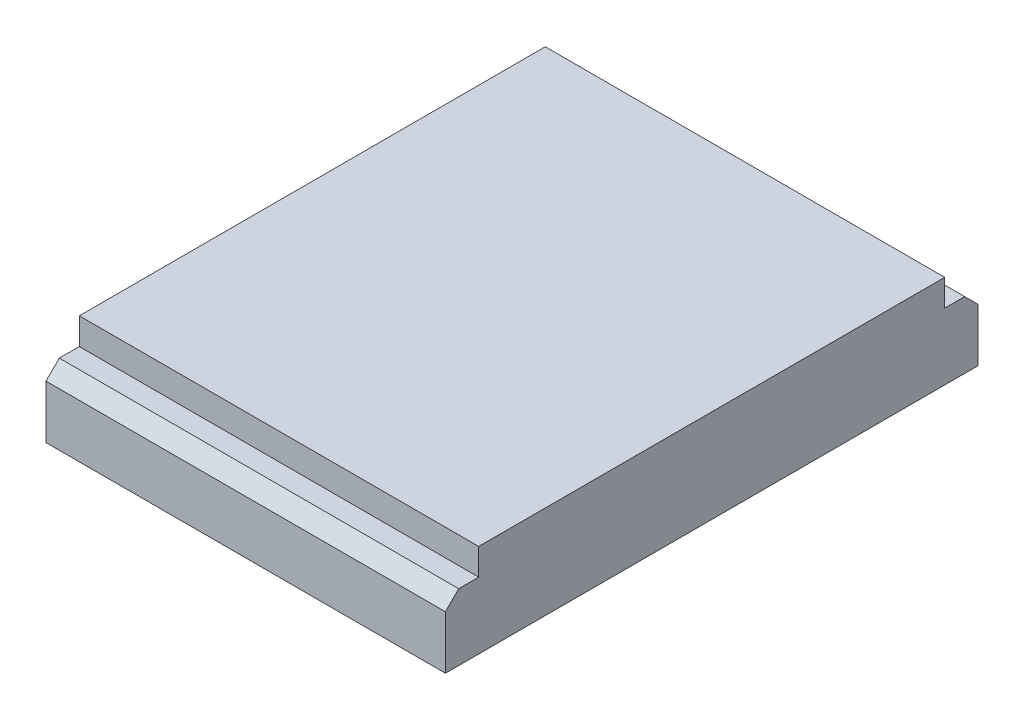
from build123d import *

# Parameters (mm, degrees)
SKETCH1_W      = 30
SKETCH1_H      = 40
EXTRUDE1_DEPTH = 5
SKETCH2_W      = 30
SKETCH2_H      = 35
EXTRUDE2_DEPTH = 2
CHAMFER1_SIZE  = 1


with BuildPart() as part:
    # Sketch1 → Extrude1 (new body)
    with BuildSketch(Plane(origin=(0, 0, 0), x_dir=(1, 0, 0), z_dir=(0, 1, 0))):
        with Locations((15, 0)):
            Rectangle(SKETCH1_W, SKETCH1_H)
    extrude(amount=EXTRUDE1_DEPTH)

    # Sketch2 → Extrude2 (add)
    with BuildSketch(Plane(origin=(0, 5, 0), x_dir=(-1, 0, 0), z_dir=(0, 1, 0))):
        with Locations((-15, 0)):
            Rectangle(SKETCH2_W, SKETCH2_H)
    extrude(amount=EXTRUDE2_DEPTH)

    # Chamfer1
    chamfer1_edges = [part.edges().sort_by_distance(p)[0] for p in [
        (15, 5, -20),
        (15, 5, 20),
    ]]
    chamfer(chamfer1_edges, length=CHAMFER1_SIZE)


solid = part.part
